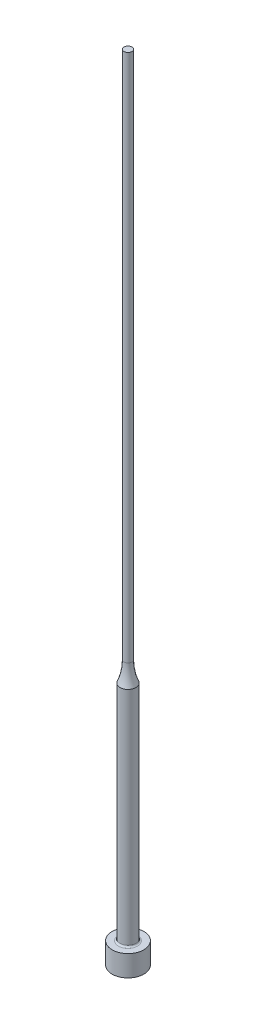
from build123d import *


with BuildPart() as part:
    # Sketch1 → Revolve1 (revolve)
    with BuildSketch(Plane.XY, mode=Mode.PRIVATE) as revolve1_sk:
        with BuildLine():
            Line((0, 0), (3, 0))
            Line((3, 0), (3, 4))
            Line((3, 4), (1.8, 4))
            ThreePointArc((1.8, 4), (1.587867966, 4.087867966), (1.5, 4.3))
            Line((1.5, 4.3), (1.5, 46.200328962))
            ThreePointArc((1.5, 46.200328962), (0.939291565, 48.063508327), (0.75, 50))
            Line((0.75, 50), (0.75, 150))
            Line((0.75, 150), (0, 150))
            Line((0, 150), (0, 0))
        make_face()
    revolve(revolve1_sk.sketch.rotate(Axis((0, 150, 0), (0, -1, 0)), 180), axis=Axis((0, 150, 0), (0, -1, 0)))


solid = part.part
